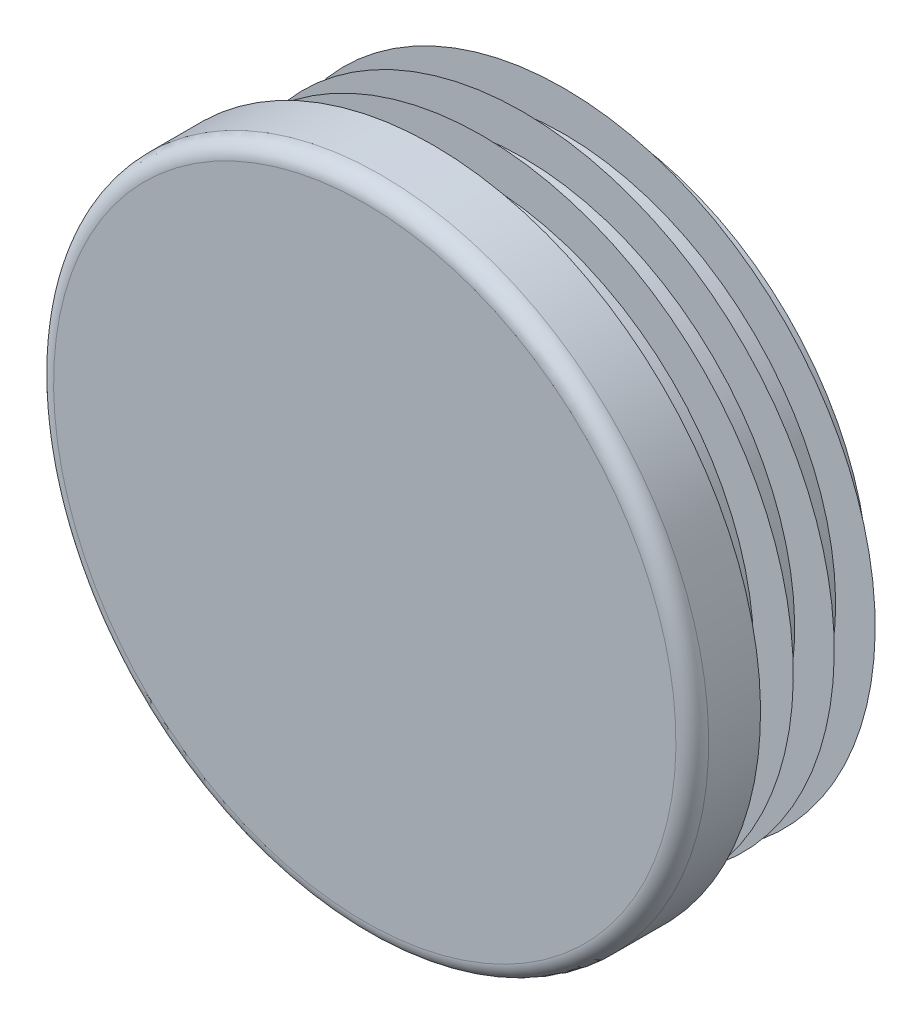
ISO-10303-21;
HEADER;
FILE_DESCRIPTION(('STEP AP214'),'2;1');
FILE_NAME('part.step','',(''),(''),'','','');
FILE_SCHEMA(('AUTOMOTIVE_DESIGN { 1 0 10303 214 1 1 1 1 }'));
ENDSEC;
DATA;
#1=APPLICATION_CONTEXT('core data for automotive mechanical design processes');
#2=APPLICATION_PROTOCOL_DEFINITION('international standard','automotive_design',2000,#1);
#3=PRODUCT_CONTEXT('',#1,'mechanical');
#4=PRODUCT('Part','Part','',(#3));
#5=PRODUCT_RELATED_PRODUCT_CATEGORY('part','',(#4));
#6=PRODUCT_DEFINITION_FORMATION('','',#4);
#7=PRODUCT_DEFINITION_CONTEXT('part definition',#1,'design');
#8=PRODUCT_DEFINITION('design','',#6,#7);
#9=PRODUCT_DEFINITION_SHAPE('','',#8);
#10=(LENGTH_UNIT() NAMED_UNIT(*) SI_UNIT(.MILLI.,.METRE.));
#11=(NAMED_UNIT(*) PLANE_ANGLE_UNIT() SI_UNIT($,.RADIAN.));
#12=(NAMED_UNIT(*) SI_UNIT($,.STERADIAN.) SOLID_ANGLE_UNIT());
#13=UNCERTAINTY_MEASURE_WITH_UNIT(LENGTH_MEASURE(1.E-05),#10,'distance_accuracy_value','');
#14=(GEOMETRIC_REPRESENTATION_CONTEXT(3) GLOBAL_UNCERTAINTY_ASSIGNED_CONTEXT((#13)) GLOBAL_UNIT_ASSIGNED_CONTEXT((#10,
#11,#12)) REPRESENTATION_CONTEXT('',''));
#15=CARTESIAN_POINT('',(0.,0.,0.));
#16=DIRECTION('',(0.,0.,1.));
#17=DIRECTION('',(1.,0.,0.));
#18=AXIS2_PLACEMENT_3D('',#15,#16,#17);
#19=CARTESIAN_POINT('',(0.,0.,5.));
#20=DIRECTION('',(0.,0.,-1.));
#21=DIRECTION('',(0.,1.,0.));
#22=AXIS2_PLACEMENT_3D('',#19,#20,#21);
#23=PLANE('',#22);
#24=CARTESIAN_POINT('',(0.,0.,5.));
#25=DIRECTION('',(0.,0.,-1.));
#26=DIRECTION('',(0.,1.,0.));
#27=AXIS2_PLACEMENT_3D('',#24,#25,#26);
#28=CIRCLE('',#27,22.8);
#29=CARTESIAN_POINT('',(0.,22.8,5.));
#30=VERTEX_POINT('',#29);
#31=EDGE_CURVE('E8',#30,#30,#28,.T.);
#32=ORIENTED_EDGE('',*,*,#31,.F.);
#33=EDGE_LOOP('',(#32));
#34=FACE_BOUND('',#33,.T.);
#35=ADVANCED_FACE('F12',(#34),#23,.F.);
#36=CARTESIAN_POINT('',(0.,0.,3.8));
#37=DIRECTION('',(0.,0.,-1.));
#38=DIRECTION('',(0.,1.,0.));
#39=AXIS2_PLACEMENT_3D('',#36,#37,#38);
#40=TOROIDAL_SURFACE('',#39,22.8,1.2);
#41=ORIENTED_EDGE('',*,*,#31,.T.);
#42=EDGE_LOOP('',(#41));
#43=FACE_BOUND('',#42,.T.);
#44=CARTESIAN_POINT('',(0.,0.,3.8));
#45=DIRECTION('',(0.,0.,-1.));
#46=DIRECTION('',(0.,1.,0.));
#47=AXIS2_PLACEMENT_3D('',#44,#45,#46);
#48=CIRCLE('',#47,24.);
#49=CARTESIAN_POINT('',(0.,24.,3.8));
#50=VERTEX_POINT('',#49);
#51=EDGE_CURVE('E18',#50,#50,#48,.T.);
#52=ORIENTED_EDGE('',*,*,#51,.F.);
#53=EDGE_LOOP('',(#52));
#54=FACE_BOUND('',#53,.T.);
#55=ADVANCED_FACE('F159',(#43,#54),#40,.T.);
#56=CARTESIAN_POINT('',(0.,0.,-12.));
#57=DIRECTION('',(0.,0.,-1.));
#58=DIRECTION('',(0.,1.,0.));
#59=AXIS2_PLACEMENT_3D('',#56,#57,#58);
#60=CYLINDRICAL_SURFACE('',#59,24.);
#61=CARTESIAN_POINT('',(0.,0.,0.));
#62=DIRECTION('',(0.,0.,-1.));
#63=DIRECTION('',(0.,1.,0.));
#64=AXIS2_PLACEMENT_3D('',#61,#62,#63);
#65=CIRCLE('',#64,24.);
#66=CARTESIAN_POINT('',(0.,24.,0.));
#67=VERTEX_POINT('',#66);
#68=EDGE_CURVE('E22',#67,#67,#65,.T.);
#69=ORIENTED_EDGE('',*,*,#68,.F.);
#70=EDGE_LOOP('',(#69));
#71=FACE_BOUND('',#70,.T.);
#72=ORIENTED_EDGE('',*,*,#51,.T.);
#73=EDGE_LOOP('',(#72));
#74=FACE_BOUND('',#73,.T.);
#75=ADVANCED_FACE('F154',(#71,#74),#60,.T.);
#76=CARTESIAN_POINT('',(24.,0.,0.));
#77=DIRECTION('',(0.,0.,1.));
#78=DIRECTION('',(0.,-1.,0.));
#79=AXIS2_PLACEMENT_3D('',#76,#77,#78);
#80=PLANE('',#79);
#81=CARTESIAN_POINT('',(0.,0.,0.));
#82=DIRECTION('',(0.,0.,-1.));
#83=DIRECTION('',(0.,1.,0.));
#84=AXIS2_PLACEMENT_3D('',#81,#82,#83);
#85=CIRCLE('',#84,19.9);
#86=CARTESIAN_POINT('',(0.,19.9,0.));
#87=VERTEX_POINT('',#86);
#88=EDGE_CURVE('E26',#87,#87,#85,.T.);
#89=ORIENTED_EDGE('',*,*,#88,.F.);
#90=EDGE_LOOP('',(#89));
#91=FACE_BOUND('',#90,.T.);
#92=ORIENTED_EDGE('',*,*,#68,.T.);
#93=EDGE_LOOP('',(#92));
#94=FACE_BOUND('',#93,.T.);
#95=ADVANCED_FACE('F148',(#91,#94),#80,.F.);
#96=CARTESIAN_POINT('',(0.,0.,-12.));
#97=DIRECTION('',(0.,0.,-1.));
#98=DIRECTION('',(0.,1.,0.));
#99=AXIS2_PLACEMENT_3D('',#96,#97,#98);
#100=CYLINDRICAL_SURFACE('',#99,19.9);
#101=CARTESIAN_POINT('',(0.,0.,-0.6));
#102=DIRECTION('',(0.,0.,-1.));
#103=DIRECTION('',(0.,1.,0.));
#104=AXIS2_PLACEMENT_3D('',#101,#102,#103);
#105=CIRCLE('',#104,19.9);
#106=CARTESIAN_POINT('',(0.,19.9,-0.6));
#107=VERTEX_POINT('',#106);
#108=EDGE_CURVE('E31',#107,#107,#105,.T.);
#109=ORIENTED_EDGE('',*,*,#108,.F.);
#110=EDGE_LOOP('',(#109));
#111=FACE_BOUND('',#110,.T.);
#112=ORIENTED_EDGE('',*,*,#88,.T.);
#113=EDGE_LOOP('',(#112));
#114=FACE_BOUND('',#113,.T.);
#115=ADVANCED_FACE('F142',(#111,#114),#100,.T.);
#116=CARTESIAN_POINT('',(19.9,0.,-0.6));
#117=DIRECTION('',(0.,0.,-1.));
#118=DIRECTION('',(0.,1.,0.));
#119=AXIS2_PLACEMENT_3D('',#116,#117,#118);
#120=PLANE('',#119);
#121=CARTESIAN_POINT('',(0.,0.,-0.6));
#122=DIRECTION('',(0.,0.,-1.));
#123=DIRECTION('',(0.,1.,0.));
#124=AXIS2_PLACEMENT_3D('',#121,#122,#123);
#125=CIRCLE('',#124,22.8);
#126=CARTESIAN_POINT('',(0.,22.8,-0.6));
#127=VERTEX_POINT('',#126);
#128=EDGE_CURVE('E34',#127,#127,#125,.T.);
#129=ORIENTED_EDGE('',*,*,#128,.F.);
#130=EDGE_LOOP('',(#129));
#131=FACE_BOUND('',#130,.T.);
#132=ORIENTED_EDGE('',*,*,#108,.T.);
#133=EDGE_LOOP('',(#132));
#134=FACE_BOUND('',#133,.T.);
#135=ADVANCED_FACE('F136',(#131,#134),#120,.F.);
#136=CARTESIAN_POINT('',(0.,0.,-0.6));
#137=DIRECTION('',(0.,0.,1.));
#138=DIRECTION('',(0.,-1.,0.));
#139=AXIS2_PLACEMENT_3D('',#136,#137,#138);
#140=CONICAL_SURFACE('',#139,22.8,0.959931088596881);
#141=CARTESIAN_POINT('',(0.,0.,-2.63060186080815));
#142=DIRECTION('',(0.,0.,-1.));
#143=DIRECTION('',(0.,1.,0.));
#144=AXIS2_PLACEMENT_3D('',#141,#142,#143);
#145=CIRCLE('',#144,19.9);
#146=CARTESIAN_POINT('',(0.,19.9,-2.63060186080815));
#147=VERTEX_POINT('',#146);
#148=EDGE_CURVE('E37',#147,#147,#145,.T.);
#149=ORIENTED_EDGE('',*,*,#148,.F.);
#150=EDGE_LOOP('',(#149));
#151=FACE_BOUND('',#150,.T.);
#152=ORIENTED_EDGE('',*,*,#128,.T.);
#153=EDGE_LOOP('',(#152));
#154=FACE_BOUND('',#153,.T.);
#155=ADVANCED_FACE('F130',(#151,#154),#140,.T.);
#156=CARTESIAN_POINT('',(0.,0.,-12.));
#157=DIRECTION('',(0.,0.,-1.));
#158=DIRECTION('',(0.,1.,0.));
#159=AXIS2_PLACEMENT_3D('',#156,#157,#158);
#160=CYLINDRICAL_SURFACE('',#159,19.9);
#161=CARTESIAN_POINT('',(0.,0.,-3.6));
#162=DIRECTION('',(0.,0.,-1.));
#163=DIRECTION('',(0.,1.,0.));
#164=AXIS2_PLACEMENT_3D('',#161,#162,#163);
#165=CIRCLE('',#164,19.9);
#166=CARTESIAN_POINT('',(0.,19.9,-3.6));
#167=VERTEX_POINT('',#166);
#168=EDGE_CURVE('E40',#167,#167,#165,.T.);
#169=ORIENTED_EDGE('',*,*,#168,.F.);
#170=EDGE_LOOP('',(#169));
#171=FACE_BOUND('',#170,.T.);
#172=ORIENTED_EDGE('',*,*,#148,.T.);
#173=EDGE_LOOP('',(#172));
#174=FACE_BOUND('',#173,.T.);
#175=ADVANCED_FACE('F124',(#171,#174),#160,.T.);
#176=CARTESIAN_POINT('',(19.9,0.,-3.6));
#177=DIRECTION('',(0.,0.,-1.));
#178=DIRECTION('',(0.,1.,0.));
#179=AXIS2_PLACEMENT_3D('',#176,#177,#178);
#180=PLANE('',#179);
#181=CARTESIAN_POINT('',(0.,0.,-3.6));
#182=DIRECTION('',(0.,0.,-1.));
#183=DIRECTION('',(0.,1.,0.));
#184=AXIS2_PLACEMENT_3D('',#181,#182,#183);
#185=CIRCLE('',#184,22.8);
#186=CARTESIAN_POINT('',(0.,22.8,-3.6));
#187=VERTEX_POINT('',#186);
#188=EDGE_CURVE('E43',#187,#187,#185,.T.);
#189=ORIENTED_EDGE('',*,*,#188,.F.);
#190=EDGE_LOOP('',(#189));
#191=FACE_BOUND('',#190,.T.);
#192=ORIENTED_EDGE('',*,*,#168,.T.);
#193=EDGE_LOOP('',(#192));
#194=FACE_BOUND('',#193,.T.);
#195=ADVANCED_FACE('F118',(#191,#194),#180,.F.);
#196=CARTESIAN_POINT('',(0.,0.,-3.6));
#197=DIRECTION('',(0.,0.,1.));
#198=DIRECTION('',(0.,-1.,0.));
#199=AXIS2_PLACEMENT_3D('',#196,#197,#198);
#200=CONICAL_SURFACE('',#199,22.8,0.959931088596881);
#201=CARTESIAN_POINT('',(0.,0.,-5.63060186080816));
#202=DIRECTION('',(0.,0.,-1.));
#203=DIRECTION('',(0.,1.,0.));
#204=AXIS2_PLACEMENT_3D('',#201,#202,#203);
#205=CIRCLE('',#204,19.9);
#206=CARTESIAN_POINT('',(0.,19.9,-5.63060186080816));
#207=VERTEX_POINT('',#206);
#208=EDGE_CURVE('E46',#207,#207,#205,.T.);
#209=ORIENTED_EDGE('',*,*,#208,.F.);
#210=EDGE_LOOP('',(#209));
#211=FACE_BOUND('',#210,.T.);
#212=ORIENTED_EDGE('',*,*,#188,.T.);
#213=EDGE_LOOP('',(#212));
#214=FACE_BOUND('',#213,.T.);
#215=ADVANCED_FACE('F112',(#211,#214),#200,.T.);
#216=CARTESIAN_POINT('',(0.,0.,-12.));
#217=DIRECTION('',(0.,0.,-1.));
#218=DIRECTION('',(0.,1.,0.));
#219=AXIS2_PLACEMENT_3D('',#216,#217,#218);
#220=CYLINDRICAL_SURFACE('',#219,19.9);
#221=CARTESIAN_POINT('',(0.,0.,-6.6));
#222=DIRECTION('',(0.,0.,-1.));
#223=DIRECTION('',(0.,1.,0.));
#224=AXIS2_PLACEMENT_3D('',#221,#222,#223);
#225=CIRCLE('',#224,19.9);
#226=CARTESIAN_POINT('',(0.,19.9,-6.6));
#227=VERTEX_POINT('',#226);
#228=EDGE_CURVE('E49',#227,#227,#225,.T.);
#229=ORIENTED_EDGE('',*,*,#228,.F.);
#230=EDGE_LOOP('',(#229));
#231=FACE_BOUND('',#230,.T.);
#232=ORIENTED_EDGE('',*,*,#208,.T.);
#233=EDGE_LOOP('',(#232));
#234=FACE_BOUND('',#233,.T.);
#235=ADVANCED_FACE('F106',(#231,#234),#220,.T.);
#236=CARTESIAN_POINT('',(19.9,0.,-6.6));
#237=DIRECTION('',(0.,0.,-1.));
#238=DIRECTION('',(0.,1.,0.));
#239=AXIS2_PLACEMENT_3D('',#236,#237,#238);
#240=PLANE('',#239);
#241=CARTESIAN_POINT('',(0.,0.,-6.6));
#242=DIRECTION('',(0.,0.,-1.));
#243=DIRECTION('',(0.,1.,0.));
#244=AXIS2_PLACEMENT_3D('',#241,#242,#243);
#245=CIRCLE('',#244,22.8);
#246=CARTESIAN_POINT('',(0.,22.8,-6.6));
#247=VERTEX_POINT('',#246);
#248=EDGE_CURVE('E52',#247,#247,#245,.T.);
#249=ORIENTED_EDGE('',*,*,#248,.F.);
#250=EDGE_LOOP('',(#249));
#251=FACE_BOUND('',#250,.T.);
#252=ORIENTED_EDGE('',*,*,#228,.T.);
#253=EDGE_LOOP('',(#252));
#254=FACE_BOUND('',#253,.T.);
#255=ADVANCED_FACE('F100',(#251,#254),#240,.F.);
#256=CARTESIAN_POINT('',(0.,0.,-6.6));
#257=DIRECTION('',(0.,0.,1.));
#258=DIRECTION('',(0.,-1.,0.));
#259=AXIS2_PLACEMENT_3D('',#256,#257,#258);
#260=CONICAL_SURFACE('',#259,22.8,0.959931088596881);
#261=CARTESIAN_POINT('',(0.,0.,-8.63060186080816));
#262=DIRECTION('',(0.,0.,-1.));
#263=DIRECTION('',(0.,1.,0.));
#264=AXIS2_PLACEMENT_3D('',#261,#262,#263);
#265=CIRCLE('',#264,19.9);
#266=CARTESIAN_POINT('',(0.,19.9,-8.63060186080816));
#267=VERTEX_POINT('',#266);
#268=EDGE_CURVE('E55',#267,#267,#265,.T.);
#269=ORIENTED_EDGE('',*,*,#268,.F.);
#270=EDGE_LOOP('',(#269));
#271=FACE_BOUND('',#270,.T.);
#272=ORIENTED_EDGE('',*,*,#248,.T.);
#273=EDGE_LOOP('',(#272));
#274=FACE_BOUND('',#273,.T.);
#275=ADVANCED_FACE('F94',(#271,#274),#260,.T.);
#276=CARTESIAN_POINT('',(0.,0.,-12.));
#277=DIRECTION('',(0.,0.,-1.));
#278=DIRECTION('',(0.,1.,0.));
#279=AXIS2_PLACEMENT_3D('',#276,#277,#278);
#280=CYLINDRICAL_SURFACE('',#279,19.9);
#281=CARTESIAN_POINT('',(0.,0.,-9.6));
#282=DIRECTION('',(0.,0.,-1.));
#283=DIRECTION('',(0.,1.,0.));
#284=AXIS2_PLACEMENT_3D('',#281,#282,#283);
#285=CIRCLE('',#284,19.9);
#286=CARTESIAN_POINT('',(0.,19.9,-9.6));
#287=VERTEX_POINT('',#286);
#288=EDGE_CURVE('E58',#287,#287,#285,.T.);
#289=ORIENTED_EDGE('',*,*,#288,.F.);
#290=EDGE_LOOP('',(#289));
#291=FACE_BOUND('',#290,.T.);
#292=ORIENTED_EDGE('',*,*,#268,.T.);
#293=EDGE_LOOP('',(#292));
#294=FACE_BOUND('',#293,.T.);
#295=ADVANCED_FACE('F88',(#291,#294),#280,.T.);
#296=CARTESIAN_POINT('',(19.9,0.,-9.6));
#297=DIRECTION('',(0.,0.,-1.));
#298=DIRECTION('',(0.,1.,0.));
#299=AXIS2_PLACEMENT_3D('',#296,#297,#298);
#300=PLANE('',#299);
#301=CARTESIAN_POINT('',(0.,0.,-9.6));
#302=DIRECTION('',(0.,0.,-1.));
#303=DIRECTION('',(0.,1.,0.));
#304=AXIS2_PLACEMENT_3D('',#301,#302,#303);
#305=CIRCLE('',#304,22.8);
#306=CARTESIAN_POINT('',(0.,22.8,-9.6));
#307=VERTEX_POINT('',#306);
#308=EDGE_CURVE('E61',#307,#307,#305,.T.);
#309=ORIENTED_EDGE('',*,*,#308,.F.);
#310=EDGE_LOOP('',(#309));
#311=FACE_BOUND('',#310,.T.);
#312=ORIENTED_EDGE('',*,*,#288,.T.);
#313=EDGE_LOOP('',(#312));
#314=FACE_BOUND('',#313,.T.);
#315=ADVANCED_FACE('F82',(#311,#314),#300,.F.);
#316=CARTESIAN_POINT('',(0.,0.,-9.6));
#317=DIRECTION('',(0.,0.,1.));
#318=DIRECTION('',(0.,-1.,0.));
#319=AXIS2_PLACEMENT_3D('',#316,#317,#318);
#320=CONICAL_SURFACE('',#319,22.8,0.959931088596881);
#321=CARTESIAN_POINT('',(0.,0.,-11.6306018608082));
#322=DIRECTION('',(0.,0.,-1.));
#323=DIRECTION('',(0.,1.,0.));
#324=AXIS2_PLACEMENT_3D('',#321,#322,#323);
#325=CIRCLE('',#324,19.9);
#326=CARTESIAN_POINT('',(0.,19.9,-11.6306018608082));
#327=VERTEX_POINT('',#326);
#328=EDGE_CURVE('E64',#327,#327,#325,.T.);
#329=ORIENTED_EDGE('',*,*,#328,.F.);
#330=EDGE_LOOP('',(#329));
#331=FACE_BOUND('',#330,.T.);
#332=ORIENTED_EDGE('',*,*,#308,.T.);
#333=EDGE_LOOP('',(#332));
#334=FACE_BOUND('',#333,.T.);
#335=ADVANCED_FACE('F76',(#331,#334),#320,.T.);
#336=CARTESIAN_POINT('',(0.,0.,-12.));
#337=DIRECTION('',(0.,0.,-1.));
#338=DIRECTION('',(0.,1.,0.));
#339=AXIS2_PLACEMENT_3D('',#336,#337,#338);
#340=CYLINDRICAL_SURFACE('',#339,19.9);
#341=CARTESIAN_POINT('',(0.,0.,-12.));
#342=DIRECTION('',(0.,0.,-1.));
#343=DIRECTION('',(0.,1.,0.));
#344=AXIS2_PLACEMENT_3D('',#341,#342,#343);
#345=CIRCLE('',#344,19.9);
#346=CARTESIAN_POINT('',(0.,19.9,-12.));
#347=VERTEX_POINT('',#346);
#348=EDGE_CURVE('E67',#347,#347,#345,.T.);
#349=ORIENTED_EDGE('',*,*,#348,.F.);
#350=EDGE_LOOP('',(#349));
#351=FACE_BOUND('',#350,.T.);
#352=ORIENTED_EDGE('',*,*,#328,.T.);
#353=EDGE_LOOP('',(#352));
#354=FACE_BOUND('',#353,.T.);
#355=ADVANCED_FACE('F73',(#351,#354),#340,.T.);
#356=CARTESIAN_POINT('',(19.9,0.,-12.));
#357=DIRECTION('',(0.,0.,1.));
#358=DIRECTION('',(0.,-1.,0.));
#359=AXIS2_PLACEMENT_3D('',#356,#357,#358);
#360=PLANE('',#359);
#361=ORIENTED_EDGE('',*,*,#348,.T.);
#362=EDGE_LOOP('',(#361));
#363=FACE_BOUND('',#362,.T.);
#364=ADVANCED_FACE('F71',(#363),#360,.F.);
#365=CLOSED_SHELL('',(#35,#55,#75,#95,#115,#135,#155,#175,#195,#215,#235,#255,#275,#295,#315,
#335,#355,#364));
#366=MANIFOLD_SOLID_BREP('B1',#365);
#367=ADVANCED_BREP_SHAPE_REPRESENTATION('',(#18,#366),#14);
#368=SHAPE_DEFINITION_REPRESENTATION(#9,#367);
ENDSEC;
END-ISO-10303-21;
